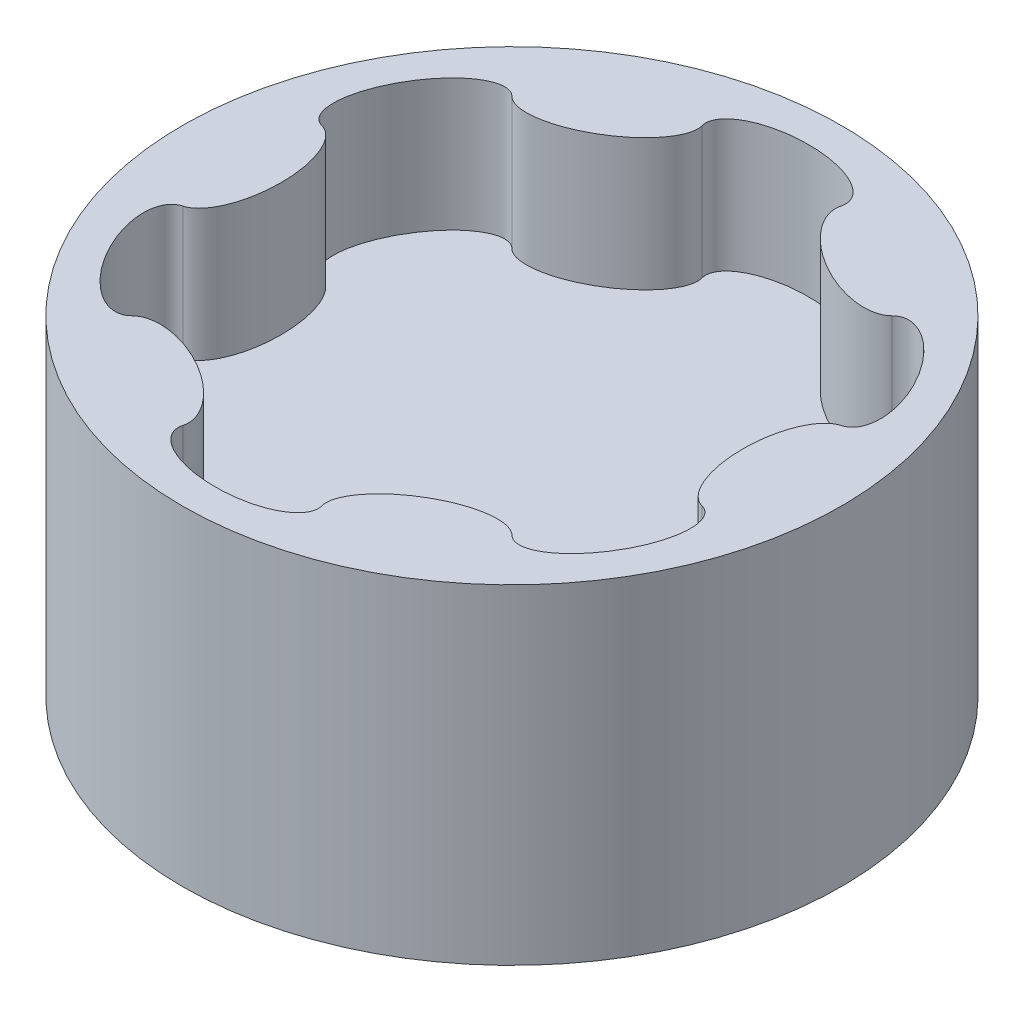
from build123d import *

# Parameters (mm, degrees)
SKETCH1_R          = 5
EXTRUDE1_DEPTH     = 2.5
CUT_EXTRUDE1_DEPTH = 2


with BuildPart() as part:
    # Sketch1 → Extrude1 (new, symmetric)
    with BuildSketch(Plane(origin=(0, 0, 0), x_dir=(1, 0, 0), z_dir=(0, 1, 0))):
        with Locations(Location((0, 0, 0), (0, 0, 270))):
            Circle(SKETCH1_R)
    extrude(amount=EXTRUDE1_DEPTH, both=True)

    # Sketch2 → Cut-Extrude1 (cut)
    with BuildSketch(Plane(origin=(0, 2.5, 0), x_dir=(-1, 0, 0), z_dir=(0, 1, 0))):
        with BuildLine():
            add(Edge.make_bspline(
                [(-3.937499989, -1.055049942), (-3.499999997, -0.937822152), (-3.5, 8e-09), (-3.500000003, 0.937822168), (-3.937499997, 1.055049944)],
                knots=[0.125327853, 0.125327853, 0.125327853, 1.570796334, 1.570796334, 3.016264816, 3.016264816, 3.016264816], degree=2, weights=[1, 0.750000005, 1, 0.750000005, 1]))
            add(Edge.make_bspline(
                [(-3.937499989, -1.055049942), (-3.968626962, -1.063390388), (-3.995796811, -1.079076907)],
                knots=[6.157857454, 6.157857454, 6.157857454, 6.283185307, 6.283185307, 6.283185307], degree=2, weights=[1, 0.998037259, 1]))
            add(Edge.make_bspline(
                [(-3.995796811, -1.079076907), (-4.45683092, -1.345255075), (-3.862968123, -2.307180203), (-3.269105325, -3.269105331), (-2.882450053, -2.882450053)],
                knots=[0, 0, 0, 1.633460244, 1.633460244, 3.266920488, 3.266920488, 3.266920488], degree=2, weights=[1, 0.684608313, 1, 0.684608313, 1]))
            add(Edge.make_bspline(
                [(-1.055049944, -3.937499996), (-0.937822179, -3.499999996), (-1.750000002, -3.031088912), (-2.562177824, -2.562177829), (-2.882450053, -2.882450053)],
                knots=[3.266920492, 3.266920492, 3.266920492, 4.712388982, 4.712388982, 6.157857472, 6.157857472, 6.157857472], degree=2, weights=[1, 0.750000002, 1, 0.750000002, 1]))
            add(Edge.make_bspline(
                [(-1.055049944, -3.937499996), (-1.196575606, -4.465680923), (-0.066592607, -4.499018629), (1.063390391, -4.532356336), (1.063390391, -4)],
                knots=[3.016264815, 3.016264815, 3.016264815, 4.649725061, 4.649725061, 6.283185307, 6.283185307, 6.283185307], degree=2, weights=[1, 0.684608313, 1, 0.684608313, 1]))
            add(Edge.make_bspline(
                [(1.063390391, -4), (1.063390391, -3.968626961), (1.055049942, -3.937499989)],
                knots=[0, 0, 0, 0.125327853, 0.125327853, 0.125327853], degree=2, weights=[1, 0.998037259, 1]))
            add(Edge.make_bspline(
                [(2.882450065, -2.882450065), (2.562177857, -2.562177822), (1.750000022, -3.0310889), (0.937822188, -3.499999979), (1.055049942, -3.937499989)],
                knots=[0.125327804, 0.125327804, 0.125327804, 1.570796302, 1.570796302, 3.016264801, 3.016264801, 3.016264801], degree=2, weights=[1, 0.749999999, 1, 0.749999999, 1]))
            add(Edge.make_bspline(
                [(2.882450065, -2.882450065), (2.905236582, -2.905236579), (2.93240642, -2.920923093)],
                knots=[6.157857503, 6.157857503, 6.157857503, 6.283185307, 6.283185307, 6.283185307], degree=2, weights=[1, 0.99803726, 1]))
            add(Edge.make_bspline(
                [(2.93240642, -2.920923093), (3.39344053, -3.18710126), (3.929560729, -2.191838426), (4.465680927, -1.196575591), (3.937499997, -1.055049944)],
                knots=[0, 0, 0, 1.633460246, 1.633460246, 3.266920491, 3.266920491, 3.266920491], degree=2, weights=[1, 0.684608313, 1, 0.684608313, 1]))
            add(Edge.make_bspline(
                [(3.937499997, 1.055049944), (3.5, 0.937822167), (3.5, 0), (3.5, -0.937822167), (3.937499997, -1.055049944)],
                knots=[3.266920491, 3.266920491, 3.266920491, 4.71238898, 4.71238898, 6.15785747, 6.15785747, 6.15785747], degree=2, weights=[1, 0.750000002, 1, 0.750000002, 1]))
            add(Edge.make_bspline(
                [(3.937499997, 1.055049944), (3.968626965, 1.06339039), (3.995796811, 1.079076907)],
                knots=[6.15785747, 6.15785747, 6.15785747, 6.283185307, 6.283185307, 6.283185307], degree=2, weights=[1, 0.998037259, 1]))
            add(Edge.make_bspline(
                [(3.995796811, 1.079076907), (4.456830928, 1.345255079), (3.862968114, 2.307180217), (3.2691053, 3.269105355), (2.882450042, 2.882450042)],
                knots=[0, 0, 0, 1.63346026, 1.63346026, 3.26692052, 3.26692052, 3.26692052], degree=2, weights=[1, 0.684608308, 1, 0.684608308, 1]))
            add(Edge.make_bspline(
                [(1.055049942, 3.937499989), (0.937822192, 3.499999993), (1.749999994, 3.031088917), (2.562177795, 2.562177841), (2.882450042, 2.882450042)],
                knots=[3.266920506, 3.266920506, 3.266920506, 4.712388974, 4.712388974, 6.157857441, 6.157857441, 6.157857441], degree=2, weights=[1, 0.750000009, 1, 0.750000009, 1]))
            add(Edge.make_bspline(
                [(1.055049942, 3.937499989), (1.063390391, 3.968626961), (1.063390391, 4)],
                knots=[6.157857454, 6.157857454, 6.157857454, 6.283185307, 6.283185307, 6.283185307], degree=2, weights=[1, 0.998037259, 1]))
            add(Edge.make_bspline(
                [(1.063390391, 4), (1.063390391, 4.532356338), (-0.066592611, 4.499018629), (-1.196575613, 4.465680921), (-1.055049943, 3.937499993)],
                knots=[0, 0, 0, 1.63346025, 1.63346025, 3.266920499, 3.266920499, 3.266920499], degree=2, weights=[1, 0.684608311, 1, 0.684608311, 1]))
            add(Edge.make_bspline(
                [(-2.882450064, 2.882450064), (-2.562177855, 2.562177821), (-1.750000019, 3.031088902), (-0.937822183, 3.499999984), (-1.055049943, 3.937499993)],
                knots=[3.266920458, 3.266920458, 3.266920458, 4.71238896, 4.71238896, 6.157857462, 6.157857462, 6.157857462], degree=2, weights=[1, 0.749999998, 1, 0.749999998, 1]))
            add(Edge.make_bspline(
                [(-2.882450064, 2.882450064), (-3.269105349, 3.269105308), (-3.862968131, 2.307180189), (-4.456830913, 1.345255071), (-3.995796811, 1.079076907)],
                knots=[3.016264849, 3.016264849, 3.016264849, 4.649725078, 4.649725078, 6.283185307, 6.283185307, 6.283185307], degree=2, weights=[1, 0.684608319, 1, 0.684608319, 1]))
            add(Edge.make_bspline(
                [(-3.995796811, 1.079076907), (-3.968626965, 1.06339039), (-3.937499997, 1.055049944)],
                knots=[0, 0, 0, 0.125327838, 0.125327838, 0.125327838], degree=2, weights=[1, 0.998037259, 1]))
        make_face()
    extrude(amount=-CUT_EXTRUDE1_DEPTH, mode=Mode.SUBTRACT)


solid = part.part
